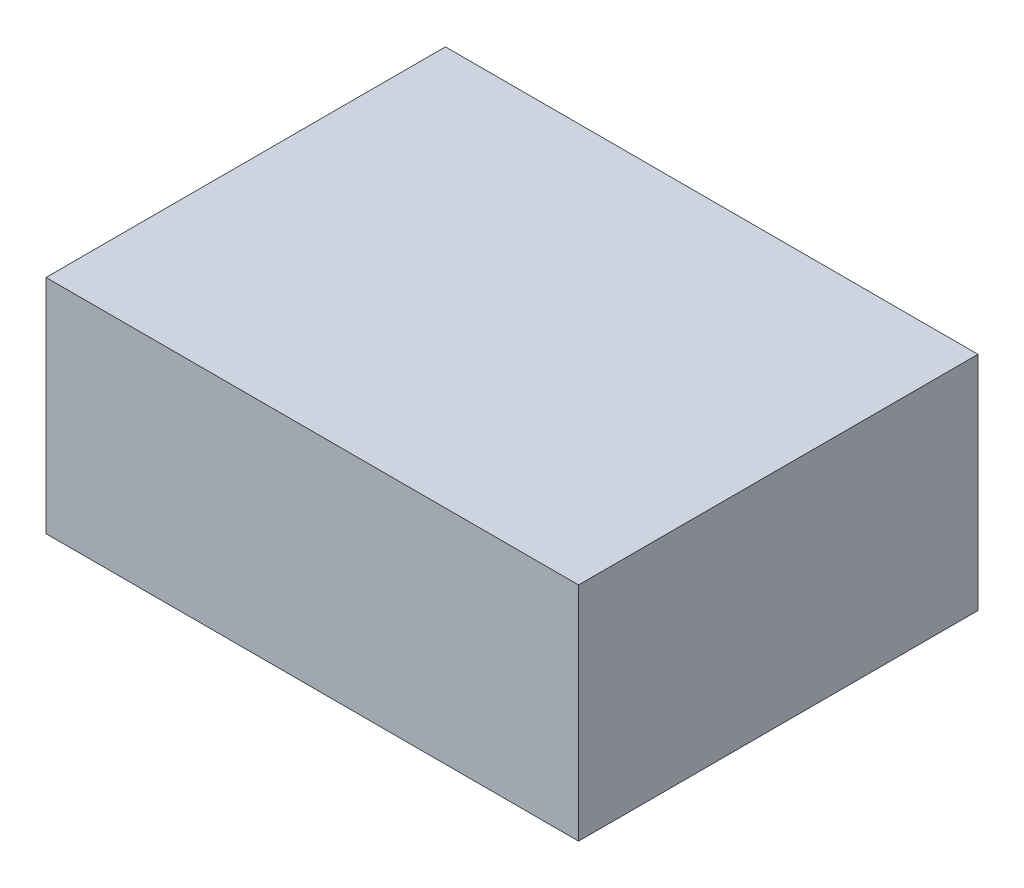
from build123d import *

# Parameters (mm, degrees)
SKETCH1_W           = 304.8
SKETCH1_H           = 228.6
BOSS_EXTRUDE1_DEPTH = 127


with BuildPart() as part:
    # Sketch1 → Boss-Extrude1 (new body)
    with BuildSketch(Plane(origin=(0, 0, 0), x_dir=(1, 0, 0), z_dir=(0, 1, 0))):
        Rectangle(SKETCH1_W, SKETCH1_H)
    extrude(amount=BOSS_EXTRUDE1_DEPTH)


solid = part.part
